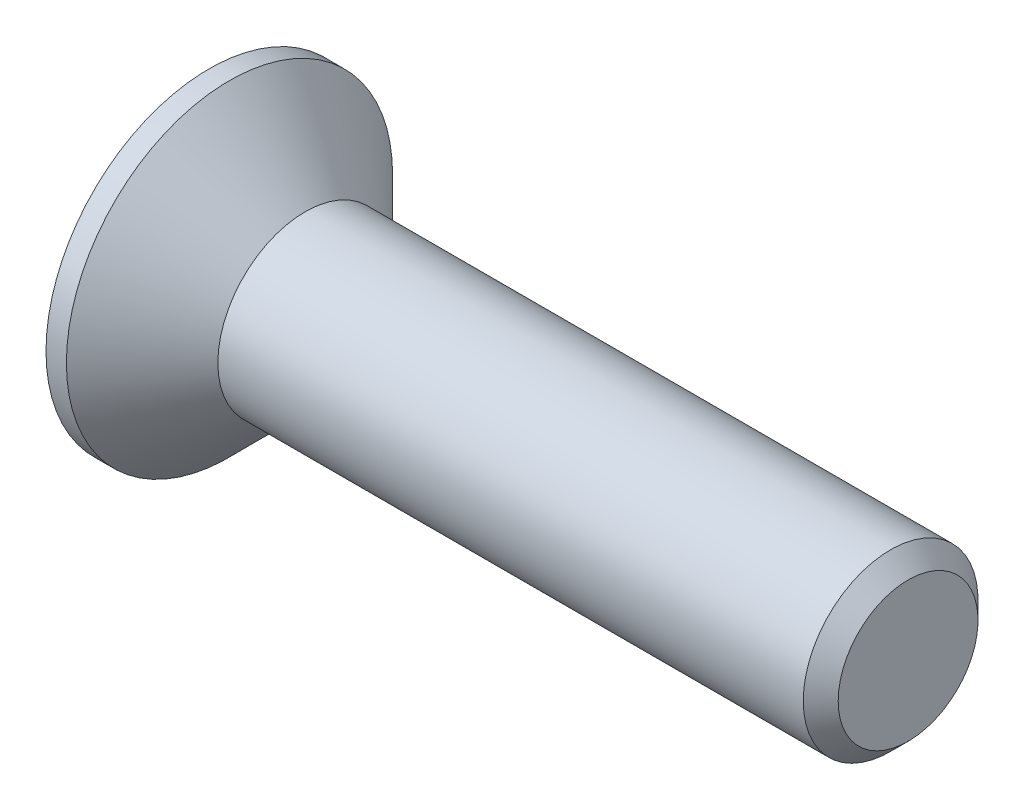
ISO-10303-21;
HEADER;
FILE_DESCRIPTION(('STEP AP214'),'2;1');
FILE_NAME('part.step','',(''),(''),'','','');
FILE_SCHEMA(('AUTOMOTIVE_DESIGN { 1 0 10303 214 1 1 1 1 }'));
ENDSEC;
DATA;
#1=APPLICATION_CONTEXT('core data for automotive mechanical design processes');
#2=APPLICATION_PROTOCOL_DEFINITION('international standard','automotive_design',2000,#1);
#3=PRODUCT_CONTEXT('',#1,'mechanical');
#4=PRODUCT('Part','Part','',(#3));
#5=PRODUCT_RELATED_PRODUCT_CATEGORY('part','',(#4));
#6=PRODUCT_DEFINITION_FORMATION('','',#4);
#7=PRODUCT_DEFINITION_CONTEXT('part definition',#1,'design');
#8=PRODUCT_DEFINITION('design','',#6,#7);
#9=PRODUCT_DEFINITION_SHAPE('','',#8);
#10=(LENGTH_UNIT() NAMED_UNIT(*) SI_UNIT(.MILLI.,.METRE.));
#11=(NAMED_UNIT(*) PLANE_ANGLE_UNIT() SI_UNIT($,.RADIAN.));
#12=(NAMED_UNIT(*) SI_UNIT($,.STERADIAN.) SOLID_ANGLE_UNIT());
#13=UNCERTAINTY_MEASURE_WITH_UNIT(LENGTH_MEASURE(1.E-05),#10,'distance_accuracy_value','');
#14=(GEOMETRIC_REPRESENTATION_CONTEXT(3) GLOBAL_UNCERTAINTY_ASSIGNED_CONTEXT((#13)) GLOBAL_UNIT_ASSIGNED_CONTEXT((#10,
#11,#12)) REPRESENTATION_CONTEXT('',''));
#15=CARTESIAN_POINT('',(0.,0.,0.));
#16=DIRECTION('',(0.,0.,1.));
#17=DIRECTION('',(1.,0.,0.));
#18=AXIS2_PLACEMENT_3D('',#15,#16,#17);
#19=CARTESIAN_POINT('',(0.,0.,0.));
#20=DIRECTION('',(-1.,0.,0.));
#21=DIRECTION('',(0.,0.,1.));
#22=AXIS2_PLACEMENT_3D('',#19,#20,#21);
#23=CONICAL_SURFACE('',#22,1.5,0.78539816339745);
#24=CARTESIAN_POINT('',(-1.3,0.,0.));
#25=DIRECTION('',(-1.,0.,0.));
#26=DIRECTION('',(0.,0.,1.));
#27=AXIS2_PLACEMENT_3D('',#24,#25,#26);
#28=CIRCLE('',#27,2.8);
#29=CARTESIAN_POINT('',(-1.3,0.,2.8));
#30=VERTEX_POINT('',#29);
#31=EDGE_CURVE('E189',#30,#30,#28,.T.);
#32=ORIENTED_EDGE('',*,*,#31,.F.);
#33=EDGE_LOOP('',(#32));
#34=FACE_BOUND('',#33,.T.);
#35=CARTESIAN_POINT('',(0.,0.,0.));
#36=DIRECTION('',(-1.,0.,0.));
#37=DIRECTION('',(0.,0.,1.));
#38=AXIS2_PLACEMENT_3D('',#35,#36,#37);
#39=CIRCLE('',#38,1.5);
#40=CARTESIAN_POINT('',(0.,0.,1.5));
#41=VERTEX_POINT('',#40);
#42=EDGE_CURVE('E212',#41,#41,#39,.T.);
#43=ORIENTED_EDGE('',*,*,#42,.T.);
#44=EDGE_LOOP('',(#43));
#45=FACE_BOUND('',#44,.T.);
#46=ADVANCED_FACE('F33',(#34,#45),#23,.T.);
#47=CARTESIAN_POINT('',(-1.65,0.,0.));
#48=DIRECTION('',(-1.,0.,0.));
#49=DIRECTION('',(0.,0.,1.));
#50=AXIS2_PLACEMENT_3D('',#47,#48,#49);
#51=CYLINDRICAL_SURFACE('',#50,1.5);
#52=CARTESIAN_POINT('',(10.05,0.,0.));
#53=DIRECTION('',(-1.,0.,0.));
#54=DIRECTION('',(0.,0.,1.));
#55=AXIS2_PLACEMENT_3D('',#52,#53,#54);
#56=CIRCLE('',#55,1.5);
#57=CARTESIAN_POINT('',(10.05,0.,1.5));
#58=VERTEX_POINT('',#57);
#59=EDGE_CURVE('E41',#58,#58,#56,.T.);
#60=ORIENTED_EDGE('',*,*,#59,.T.);
#61=EDGE_LOOP('',(#60));
#62=FACE_BOUND('',#61,.T.);
#63=ORIENTED_EDGE('',*,*,#42,.F.);
#64=EDGE_LOOP('',(#63));
#65=FACE_BOUND('',#64,.T.);
#66=ADVANCED_FACE('F217',(#62,#65),#51,.T.);
#67=CARTESIAN_POINT('',(10.35,0.,0.));
#68=DIRECTION('',(-1.,0.,0.));
#69=DIRECTION('',(0.,0.,1.));
#70=AXIS2_PLACEMENT_3D('',#67,#68,#69);
#71=PLANE('',#70);
#72=CARTESIAN_POINT('',(10.35,0.,0.));
#73=DIRECTION('',(-1.,0.,0.));
#74=DIRECTION('',(0.,0.,1.));
#75=AXIS2_PLACEMENT_3D('',#72,#73,#74);
#76=CIRCLE('',#75,1.2);
#77=CARTESIAN_POINT('',(10.35,0.,1.2));
#78=VERTEX_POINT('',#77);
#79=EDGE_CURVE('E11',#78,#78,#76,.F.);
#80=ORIENTED_EDGE('',*,*,#79,.T.);
#81=EDGE_LOOP('',(#80));
#82=FACE_BOUND('',#81,.T.);
#83=ADVANCED_FACE('F239',(#82),#71,.F.);
#84=CARTESIAN_POINT('',(-1.65,2.8,0.));
#85=DIRECTION('',(1.,0.,0.));
#86=DIRECTION('',(0.,0.,-1.));
#87=AXIS2_PLACEMENT_3D('',#84,#85,#86);
#88=PLANE('',#87);
#89=DIRECTION('',(0.,0.,-1.));
#90=VECTOR('',#89,1.);
#91=CARTESIAN_POINT('',(-1.65,0.365,-1.45));
#92=LINE('',#91,#90);
#93=CARTESIAN_POINT('',(-1.65,0.365,-0.365));
#94=VERTEX_POINT('',#93);
#95=CARTESIAN_POINT('',(-1.65,0.365,-1.45));
#96=VERTEX_POINT('',#95);
#97=EDGE_CURVE('E158',#94,#96,#92,.T.);
#98=ORIENTED_EDGE('',*,*,#97,.F.);
#99=DIRECTION('',(0.,-1.,0.));
#100=VECTOR('',#99,1.);
#101=CARTESIAN_POINT('',(-1.65,0.365,-0.365));
#102=LINE('',#101,#100);
#103=CARTESIAN_POINT('',(-1.65,1.45,-0.365));
#104=VERTEX_POINT('',#103);
#105=EDGE_CURVE('E48',#104,#94,#102,.T.);
#106=ORIENTED_EDGE('',*,*,#105,.F.);
#107=DIRECTION('',(0.,0.,-1.));
#108=VECTOR('',#107,1.);
#109=CARTESIAN_POINT('',(-1.65,1.45,-0.365));
#110=LINE('',#109,#108);
#111=CARTESIAN_POINT('',(-1.65,1.45,0.365));
#112=VERTEX_POINT('',#111);
#113=EDGE_CURVE('E185',#112,#104,#110,.T.);
#114=ORIENTED_EDGE('',*,*,#113,.F.);
#115=DIRECTION('',(0.,1.,0.));
#116=VECTOR('',#115,1.);
#117=CARTESIAN_POINT('',(-1.65,1.45,0.365));
#118=LINE('',#117,#116);
#119=CARTESIAN_POINT('',(-1.65,0.365,0.365));
#120=VERTEX_POINT('',#119);
#121=EDGE_CURVE('E183',#120,#112,#118,.T.);
#122=ORIENTED_EDGE('',*,*,#121,.F.);
#123=DIRECTION('',(0.,0.,-1.));
#124=VECTOR('',#123,1.);
#125=CARTESIAN_POINT('',(-1.65,0.365,0.365));
#126=LINE('',#125,#124);
#127=CARTESIAN_POINT('',(-1.65,0.365,1.45));
#128=VERTEX_POINT('',#127);
#129=EDGE_CURVE('E132',#128,#120,#126,.T.);
#130=ORIENTED_EDGE('',*,*,#129,.F.);
#131=DIRECTION('',(0.,1.,0.));
#132=VECTOR('',#131,1.);
#133=CARTESIAN_POINT('',(-1.65,0.365,1.45));
#134=LINE('',#133,#132);
#135=CARTESIAN_POINT('',(-1.65,-0.365,1.45));
#136=VERTEX_POINT('',#135);
#137=EDGE_CURVE('E179',#136,#128,#134,.T.);
#138=ORIENTED_EDGE('',*,*,#137,.F.);
#139=DIRECTION('',(0.,0.,1.));
#140=VECTOR('',#139,1.);
#141=CARTESIAN_POINT('',(-1.65,-0.365,1.45));
#142=LINE('',#141,#140);
#143=CARTESIAN_POINT('',(-1.65,-0.365,0.365));
#144=VERTEX_POINT('',#143);
#145=EDGE_CURVE('E176',#144,#136,#142,.T.);
#146=ORIENTED_EDGE('',*,*,#145,.F.);
#147=DIRECTION('',(0.,1.,0.));
#148=VECTOR('',#147,1.);
#149=CARTESIAN_POINT('',(-1.65,-0.365,0.365));
#150=LINE('',#149,#148);
#151=CARTESIAN_POINT('',(-1.65,-1.45,0.365));
#152=VERTEX_POINT('',#151);
#153=EDGE_CURVE('E173',#152,#144,#150,.T.);
#154=ORIENTED_EDGE('',*,*,#153,.F.);
#155=DIRECTION('',(0.,0.,1.));
#156=VECTOR('',#155,1.);
#157=CARTESIAN_POINT('',(-1.65,-1.45,0.365));
#158=LINE('',#157,#156);
#159=CARTESIAN_POINT('',(-1.65,-1.45,-0.365));
#160=VERTEX_POINT('',#159);
#161=EDGE_CURVE('E170',#160,#152,#158,.T.);
#162=ORIENTED_EDGE('',*,*,#161,.F.);
#163=DIRECTION('',(0.,-1.,0.));
#164=VECTOR('',#163,1.);
#165=CARTESIAN_POINT('',(-1.65,-1.45,-0.365));
#166=LINE('',#165,#164);
#167=CARTESIAN_POINT('',(-1.65,-0.365,-0.365));
#168=VERTEX_POINT('',#167);
#169=EDGE_CURVE('E167',#168,#160,#166,.T.);
#170=ORIENTED_EDGE('',*,*,#169,.F.);
#171=DIRECTION('',(0.,0.,1.));
#172=VECTOR('',#171,1.);
#173=CARTESIAN_POINT('',(-1.65,-0.365,-0.365));
#174=LINE('',#173,#172);
#175=CARTESIAN_POINT('',(-1.65,-0.365,-1.45));
#176=VERTEX_POINT('',#175);
#177=EDGE_CURVE('E164',#176,#168,#174,.T.);
#178=ORIENTED_EDGE('',*,*,#177,.F.);
#179=DIRECTION('',(0.,-1.,0.));
#180=VECTOR('',#179,1.);
#181=CARTESIAN_POINT('',(-1.65,-0.365,-1.45));
#182=LINE('',#181,#180);
#183=EDGE_CURVE('E161',#96,#176,#182,.T.);
#184=ORIENTED_EDGE('',*,*,#183,.F.);
#185=EDGE_LOOP('',(#98,#106,#114,#122,#130,#138,#146,#154,#162,#170,#178,#184));
#186=FACE_BOUND('',#185,.T.);
#187=CARTESIAN_POINT('',(-1.65,0.,0.));
#188=DIRECTION('',(-1.,0.,0.));
#189=DIRECTION('',(0.,0.,1.));
#190=AXIS2_PLACEMENT_3D('',#187,#188,#189);
#191=CIRCLE('',#190,2.8);
#192=CARTESIAN_POINT('',(-1.65,0.,2.8));
#193=VERTEX_POINT('',#192);
#194=EDGE_CURVE('E209',#193,#193,#191,.T.);
#195=ORIENTED_EDGE('',*,*,#194,.T.);
#196=EDGE_LOOP('',(#195));
#197=FACE_BOUND('',#196,.T.);
#198=ADVANCED_FACE('F230',(#186,#197),#88,.F.);
#199=CARTESIAN_POINT('',(-1.65,0.,0.));
#200=DIRECTION('',(-1.,0.,0.));
#201=DIRECTION('',(0.,0.,1.));
#202=AXIS2_PLACEMENT_3D('',#199,#200,#201);
#203=CYLINDRICAL_SURFACE('',#202,2.8);
#204=ORIENTED_EDGE('',*,*,#194,.F.);
#205=EDGE_LOOP('',(#204));
#206=FACE_BOUND('',#205,.T.);
#207=ORIENTED_EDGE('',*,*,#31,.T.);
#208=EDGE_LOOP('',(#207));
#209=FACE_BOUND('',#208,.T.);
#210=ADVANCED_FACE('F222',(#206,#209),#203,.T.);
#211=CARTESIAN_POINT('',(10.05,0.,0.));
#212=DIRECTION('',(-1.,0.,0.));
#213=DIRECTION('',(0.,0.,1.));
#214=AXIS2_PLACEMENT_3D('',#211,#212,#213);
#215=CONICAL_SURFACE('',#214,1.5,0.785398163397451);
#216=ORIENTED_EDGE('',*,*,#79,.F.);
#217=EDGE_LOOP('',(#216));
#218=FACE_BOUND('',#217,.T.);
#219=ORIENTED_EDGE('',*,*,#59,.F.);
#220=EDGE_LOOP('',(#219));
#221=FACE_BOUND('',#220,.T.);
#222=ADVANCED_FACE('F35',(#218,#221),#215,.T.);
#223=CARTESIAN_POINT('',(-0.4,0.365,-0.365));
#224=DIRECTION('',(0.,0.,-1.));
#225=DIRECTION('',(-1.,0.,0.));
#226=AXIS2_PLACEMENT_3D('',#223,#224,#225);
#227=PLANE('',#226);
#228=ORIENTED_EDGE('',*,*,#105,.T.);
#229=DIRECTION('',(-1.,0.,0.));
#230=VECTOR('',#229,1.);
#231=CARTESIAN_POINT('',(-0.4,0.365,-0.365));
#232=LINE('',#231,#230);
#233=CARTESIAN_POINT('',(-0.4,0.365,-0.365));
#234=VERTEX_POINT('',#233);
#235=EDGE_CURVE('E96',#234,#94,#232,.T.);
#236=ORIENTED_EDGE('',*,*,#235,.F.);
#237=DIRECTION('',(0.,-1.,0.));
#238=VECTOR('',#237,1.);
#239=CARTESIAN_POINT('',(-0.4,0.365,-0.365));
#240=LINE('',#239,#238);
#241=CARTESIAN_POINT('',(-0.4,1.45,-0.365));
#242=VERTEX_POINT('',#241);
#243=EDGE_CURVE('E187',#242,#234,#240,.T.);
#244=ORIENTED_EDGE('',*,*,#243,.F.);
#245=DIRECTION('',(-1.,0.,0.));
#246=VECTOR('',#245,1.);
#247=CARTESIAN_POINT('',(-0.4,1.45,-0.365));
#248=LINE('',#247,#246);
#249=EDGE_CURVE('E56',#242,#104,#248,.T.);
#250=ORIENTED_EDGE('',*,*,#249,.T.);
#251=EDGE_LOOP('',(#228,#236,#244,#250));
#252=FACE_BOUND('',#251,.T.);
#253=ADVANCED_FACE('F221',(#252),#227,.F.);
#254=CARTESIAN_POINT('',(-0.4,1.45,-0.365));
#255=DIRECTION('',(0.,1.,0.));
#256=DIRECTION('',(-1.,0.,0.));
#257=AXIS2_PLACEMENT_3D('',#254,#255,#256);
#258=PLANE('',#257);
#259=ORIENTED_EDGE('',*,*,#113,.T.);
#260=ORIENTED_EDGE('',*,*,#249,.F.);
#261=DIRECTION('',(0.,0.,-1.));
#262=VECTOR('',#261,1.);
#263=CARTESIAN_POINT('',(-0.4,1.45,-0.365));
#264=LINE('',#263,#262);
#265=CARTESIAN_POINT('',(-0.4,1.45,0.365));
#266=VERTEX_POINT('',#265);
#267=EDGE_CURVE('E144',#266,#242,#264,.T.);
#268=ORIENTED_EDGE('',*,*,#267,.F.);
#269=DIRECTION('',(-1.,0.,0.));
#270=VECTOR('',#269,1.);
#271=CARTESIAN_POINT('',(-0.4,1.45,0.365));
#272=LINE('',#271,#270);
#273=EDGE_CURVE('E136',#266,#112,#272,.T.);
#274=ORIENTED_EDGE('',*,*,#273,.T.);
#275=EDGE_LOOP('',(#259,#260,#268,#274));
#276=FACE_BOUND('',#275,.T.);
#277=ADVANCED_FACE('F228',(#276),#258,.F.);
#278=CARTESIAN_POINT('',(-0.4,1.45,0.365));
#279=DIRECTION('',(0.,0.,1.));
#280=DIRECTION('',(1.,0.,0.));
#281=AXIS2_PLACEMENT_3D('',#278,#279,#280);
#282=PLANE('',#281);
#283=ORIENTED_EDGE('',*,*,#121,.T.);
#284=ORIENTED_EDGE('',*,*,#273,.F.);
#285=DIRECTION('',(0.,1.,0.));
#286=VECTOR('',#285,1.);
#287=CARTESIAN_POINT('',(-0.4,1.45,0.365));
#288=LINE('',#287,#286);
#289=CARTESIAN_POINT('',(-0.4,0.365,0.365));
#290=VERTEX_POINT('',#289);
#291=EDGE_CURVE('E140',#290,#266,#288,.T.);
#292=ORIENTED_EDGE('',*,*,#291,.F.);
#293=DIRECTION('',(-1.,0.,0.));
#294=VECTOR('',#293,1.);
#295=CARTESIAN_POINT('',(-0.4,0.365,0.365));
#296=LINE('',#295,#294);
#297=EDGE_CURVE('E125',#290,#120,#296,.T.);
#298=ORIENTED_EDGE('',*,*,#297,.T.);
#299=EDGE_LOOP('',(#283,#284,#292,#298));
#300=FACE_BOUND('',#299,.T.);
#301=ADVANCED_FACE('F141',(#300),#282,.F.);
#302=CARTESIAN_POINT('',(-0.4,0.365,0.365));
#303=DIRECTION('',(0.,1.,0.));
#304=DIRECTION('',(-1.,0.,0.));
#305=AXIS2_PLACEMENT_3D('',#302,#303,#304);
#306=PLANE('',#305);
#307=ORIENTED_EDGE('',*,*,#129,.T.);
#308=ORIENTED_EDGE('',*,*,#297,.F.);
#309=DIRECTION('',(0.,0.,-1.));
#310=VECTOR('',#309,1.);
#311=CARTESIAN_POINT('',(-0.4,0.365,0.365));
#312=LINE('',#311,#310);
#313=CARTESIAN_POINT('',(-0.4,0.365,1.45));
#314=VERTEX_POINT('',#313);
#315=EDGE_CURVE('E129',#314,#290,#312,.T.);
#316=ORIENTED_EDGE('',*,*,#315,.F.);
#317=DIRECTION('',(-1.,0.,0.));
#318=VECTOR('',#317,1.);
#319=CARTESIAN_POINT('',(-0.4,0.365,1.45));
#320=LINE('',#319,#318);
#321=EDGE_CURVE('E137',#314,#128,#320,.T.);
#322=ORIENTED_EDGE('',*,*,#321,.T.);
#323=EDGE_LOOP('',(#307,#308,#316,#322));
#324=FACE_BOUND('',#323,.T.);
#325=ADVANCED_FACE('F127',(#324),#306,.F.);
#326=CARTESIAN_POINT('',(-0.4,0.365,1.45));
#327=DIRECTION('',(0.,0.,1.));
#328=DIRECTION('',(1.,0.,0.));
#329=AXIS2_PLACEMENT_3D('',#326,#327,#328);
#330=PLANE('',#329);
#331=ORIENTED_EDGE('',*,*,#137,.T.);
#332=ORIENTED_EDGE('',*,*,#321,.F.);
#333=DIRECTION('',(0.,1.,0.));
#334=VECTOR('',#333,1.);
#335=CARTESIAN_POINT('',(-0.4,0.365,1.45));
#336=LINE('',#335,#334);
#337=CARTESIAN_POINT('',(-0.4,-0.365,1.45));
#338=VERTEX_POINT('',#337);
#339=EDGE_CURVE('E150',#338,#314,#336,.T.);
#340=ORIENTED_EDGE('',*,*,#339,.F.);
#341=DIRECTION('',(-1.,0.,0.));
#342=VECTOR('',#341,1.);
#343=CARTESIAN_POINT('',(-0.4,-0.365,1.45));
#344=LINE('',#343,#342);
#345=EDGE_CURVE('E192',#338,#136,#344,.T.);
#346=ORIENTED_EDGE('',*,*,#345,.T.);
#347=EDGE_LOOP('',(#331,#332,#340,#346));
#348=FACE_BOUND('',#347,.T.);
#349=ADVANCED_FACE('F277',(#348),#330,.F.);
#350=CARTESIAN_POINT('',(-0.4,-0.365,1.45));
#351=DIRECTION('',(0.,-1.,0.));
#352=DIRECTION('',(1.,0.,0.));
#353=AXIS2_PLACEMENT_3D('',#350,#351,#352);
#354=PLANE('',#353);
#355=ORIENTED_EDGE('',*,*,#145,.T.);
#356=ORIENTED_EDGE('',*,*,#345,.F.);
#357=DIRECTION('',(0.,0.,1.));
#358=VECTOR('',#357,1.);
#359=CARTESIAN_POINT('',(-0.4,-0.365,1.45));
#360=LINE('',#359,#358);
#361=CARTESIAN_POINT('',(-0.4,-0.365,0.365));
#362=VERTEX_POINT('',#361);
#363=EDGE_CURVE('E152',#362,#338,#360,.T.);
#364=ORIENTED_EDGE('',*,*,#363,.F.);
#365=DIRECTION('',(-1.,0.,0.));
#366=VECTOR('',#365,1.);
#367=CARTESIAN_POINT('',(-0.4,-0.365,0.365));
#368=LINE('',#367,#366);
#369=EDGE_CURVE('E194',#362,#144,#368,.T.);
#370=ORIENTED_EDGE('',*,*,#369,.T.);
#371=EDGE_LOOP('',(#355,#356,#364,#370));
#372=FACE_BOUND('',#371,.T.);
#373=ADVANCED_FACE('F273',(#372),#354,.F.);
#374=CARTESIAN_POINT('',(-0.4,-0.365,0.365));
#375=DIRECTION('',(0.,0.,1.));
#376=DIRECTION('',(1.,0.,0.));
#377=AXIS2_PLACEMENT_3D('',#374,#375,#376);
#378=PLANE('',#377);
#379=ORIENTED_EDGE('',*,*,#153,.T.);
#380=ORIENTED_EDGE('',*,*,#369,.F.);
#381=DIRECTION('',(0.,1.,0.));
#382=VECTOR('',#381,1.);
#383=CARTESIAN_POINT('',(-0.4,-0.365,0.365));
#384=LINE('',#383,#382);
#385=CARTESIAN_POINT('',(-0.4,-1.45,0.365));
#386=VERTEX_POINT('',#385);
#387=EDGE_CURVE('E422',#386,#362,#384,.T.);
#388=ORIENTED_EDGE('',*,*,#387,.F.);
#389=DIRECTION('',(-1.,0.,0.));
#390=VECTOR('',#389,1.);
#391=CARTESIAN_POINT('',(-0.4,-1.45,0.365));
#392=LINE('',#391,#390);
#393=EDGE_CURVE('E196',#386,#152,#392,.T.);
#394=ORIENTED_EDGE('',*,*,#393,.T.);
#395=EDGE_LOOP('',(#379,#380,#388,#394));
#396=FACE_BOUND('',#395,.T.);
#397=ADVANCED_FACE('F269',(#396),#378,.F.);
#398=CARTESIAN_POINT('',(-0.4,-1.45,0.365));
#399=DIRECTION('',(0.,-1.,0.));
#400=DIRECTION('',(1.,0.,0.));
#401=AXIS2_PLACEMENT_3D('',#398,#399,#400);
#402=PLANE('',#401);
#403=ORIENTED_EDGE('',*,*,#161,.T.);
#404=ORIENTED_EDGE('',*,*,#393,.F.);
#405=DIRECTION('',(0.,0.,1.));
#406=VECTOR('',#405,1.);
#407=CARTESIAN_POINT('',(-0.4,-1.45,0.365));
#408=LINE('',#407,#406);
#409=CARTESIAN_POINT('',(-0.4,-1.45,-0.365));
#410=VERTEX_POINT('',#409);
#411=EDGE_CURVE('E419',#410,#386,#408,.T.);
#412=ORIENTED_EDGE('',*,*,#411,.F.);
#413=DIRECTION('',(-1.,0.,0.));
#414=VECTOR('',#413,1.);
#415=CARTESIAN_POINT('',(-0.4,-1.45,-0.365));
#416=LINE('',#415,#414);
#417=EDGE_CURVE('E198',#410,#160,#416,.T.);
#418=ORIENTED_EDGE('',*,*,#417,.T.);
#419=EDGE_LOOP('',(#403,#404,#412,#418));
#420=FACE_BOUND('',#419,.T.);
#421=ADVANCED_FACE('F265',(#420),#402,.F.);
#422=CARTESIAN_POINT('',(-0.4,-1.45,-0.365));
#423=DIRECTION('',(0.,0.,-1.));
#424=DIRECTION('',(-1.,0.,0.));
#425=AXIS2_PLACEMENT_3D('',#422,#423,#424);
#426=PLANE('',#425);
#427=ORIENTED_EDGE('',*,*,#169,.T.);
#428=ORIENTED_EDGE('',*,*,#417,.F.);
#429=DIRECTION('',(0.,-1.,0.));
#430=VECTOR('',#429,1.);
#431=CARTESIAN_POINT('',(-0.4,-1.45,-0.365));
#432=LINE('',#431,#430);
#433=CARTESIAN_POINT('',(-0.4,-0.365,-0.365));
#434=VERTEX_POINT('',#433);
#435=EDGE_CURVE('E416',#434,#410,#432,.T.);
#436=ORIENTED_EDGE('',*,*,#435,.F.);
#437=DIRECTION('',(-1.,0.,0.));
#438=VECTOR('',#437,1.);
#439=CARTESIAN_POINT('',(-0.4,-0.365,-0.365));
#440=LINE('',#439,#438);
#441=EDGE_CURVE('E200',#434,#168,#440,.T.);
#442=ORIENTED_EDGE('',*,*,#441,.T.);
#443=EDGE_LOOP('',(#427,#428,#436,#442));
#444=FACE_BOUND('',#443,.T.);
#445=ADVANCED_FACE('F261',(#444),#426,.F.);
#446=CARTESIAN_POINT('',(-0.4,-0.365,-0.365));
#447=DIRECTION('',(0.,-1.,0.));
#448=DIRECTION('',(1.,0.,0.));
#449=AXIS2_PLACEMENT_3D('',#446,#447,#448);
#450=PLANE('',#449);
#451=ORIENTED_EDGE('',*,*,#177,.T.);
#452=ORIENTED_EDGE('',*,*,#441,.F.);
#453=DIRECTION('',(0.,0.,1.));
#454=VECTOR('',#453,1.);
#455=CARTESIAN_POINT('',(-0.4,-0.365,-0.365));
#456=LINE('',#455,#454);
#457=CARTESIAN_POINT('',(-0.4,-0.365,-1.45));
#458=VERTEX_POINT('',#457);
#459=EDGE_CURVE('E413',#458,#434,#456,.T.);
#460=ORIENTED_EDGE('',*,*,#459,.F.);
#461=DIRECTION('',(-1.,0.,0.));
#462=VECTOR('',#461,1.);
#463=CARTESIAN_POINT('',(-0.4,-0.365,-1.45));
#464=LINE('',#463,#462);
#465=EDGE_CURVE('E202',#458,#176,#464,.T.);
#466=ORIENTED_EDGE('',*,*,#465,.T.);
#467=EDGE_LOOP('',(#451,#452,#460,#466));
#468=FACE_BOUND('',#467,.T.);
#469=ADVANCED_FACE('F257',(#468),#450,.F.);
#470=CARTESIAN_POINT('',(-0.4,-0.365,-1.45));
#471=DIRECTION('',(0.,0.,-1.));
#472=DIRECTION('',(-1.,0.,0.));
#473=AXIS2_PLACEMENT_3D('',#470,#471,#472);
#474=PLANE('',#473);
#475=ORIENTED_EDGE('',*,*,#183,.T.);
#476=ORIENTED_EDGE('',*,*,#465,.F.);
#477=DIRECTION('',(0.,-1.,0.));
#478=VECTOR('',#477,1.);
#479=CARTESIAN_POINT('',(-0.4,-0.365,-1.45));
#480=LINE('',#479,#478);
#481=CARTESIAN_POINT('',(-0.4,0.365,-1.45));
#482=VERTEX_POINT('',#481);
#483=EDGE_CURVE('E408',#482,#458,#480,.T.);
#484=ORIENTED_EDGE('',*,*,#483,.F.);
#485=DIRECTION('',(-1.,0.,0.));
#486=VECTOR('',#485,1.);
#487=CARTESIAN_POINT('',(-0.4,0.365,-1.45));
#488=LINE('',#487,#486);
#489=EDGE_CURVE('E204',#482,#96,#488,.T.);
#490=ORIENTED_EDGE('',*,*,#489,.T.);
#491=EDGE_LOOP('',(#475,#476,#484,#490));
#492=FACE_BOUND('',#491,.T.);
#493=ADVANCED_FACE('F253',(#492),#474,.F.);
#494=CARTESIAN_POINT('',(-0.4,0.365,-1.45));
#495=DIRECTION('',(0.,1.,0.));
#496=DIRECTION('',(-1.,0.,0.));
#497=AXIS2_PLACEMENT_3D('',#494,#495,#496);
#498=PLANE('',#497);
#499=ORIENTED_EDGE('',*,*,#97,.T.);
#500=ORIENTED_EDGE('',*,*,#489,.F.);
#501=DIRECTION('',(0.,0.,-1.));
#502=VECTOR('',#501,1.);
#503=CARTESIAN_POINT('',(-0.4,0.365,-1.45));
#504=LINE('',#503,#502);
#505=EDGE_CURVE('E406',#234,#482,#504,.T.);
#506=ORIENTED_EDGE('',*,*,#505,.F.);
#507=ORIENTED_EDGE('',*,*,#235,.T.);
#508=EDGE_LOOP('',(#499,#500,#506,#507));
#509=FACE_BOUND('',#508,.T.);
#510=ADVANCED_FACE('F250',(#509),#498,.F.);
#511=CARTESIAN_POINT('',(-0.4,0.,0.));
#512=DIRECTION('',(1.,0.,0.));
#513=DIRECTION('',(0.,0.,-1.));
#514=AXIS2_PLACEMENT_3D('',#511,#512,#513);
#515=PLANE('',#514);
#516=ORIENTED_EDGE('',*,*,#243,.T.);
#517=ORIENTED_EDGE('',*,*,#505,.T.);
#518=ORIENTED_EDGE('',*,*,#483,.T.);
#519=ORIENTED_EDGE('',*,*,#459,.T.);
#520=ORIENTED_EDGE('',*,*,#435,.T.);
#521=ORIENTED_EDGE('',*,*,#411,.T.);
#522=ORIENTED_EDGE('',*,*,#387,.T.);
#523=ORIENTED_EDGE('',*,*,#363,.T.);
#524=ORIENTED_EDGE('',*,*,#339,.T.);
#525=ORIENTED_EDGE('',*,*,#315,.T.);
#526=ORIENTED_EDGE('',*,*,#291,.T.);
#527=ORIENTED_EDGE('',*,*,#267,.T.);
#528=EDGE_LOOP('',(#516,#517,#518,#519,#520,#521,#522,#523,#524,#525,#526,#527));
#529=FACE_BOUND('',#528,.T.);
#530=ADVANCED_FACE('F147',(#529),#515,.F.);
#531=CLOSED_SHELL('',(#46,#66,#83,#198,#210,#222,#253,#277,#301,#325,#349,#373,#397,#421,#445,
#469,#493,#510,#530));
#532=MANIFOLD_SOLID_BREP('B2',#531);
#533=ADVANCED_BREP_SHAPE_REPRESENTATION('',(#18,#532),#14);
#534=SHAPE_DEFINITION_REPRESENTATION(#9,#533);
ENDSEC;
END-ISO-10303-21;
